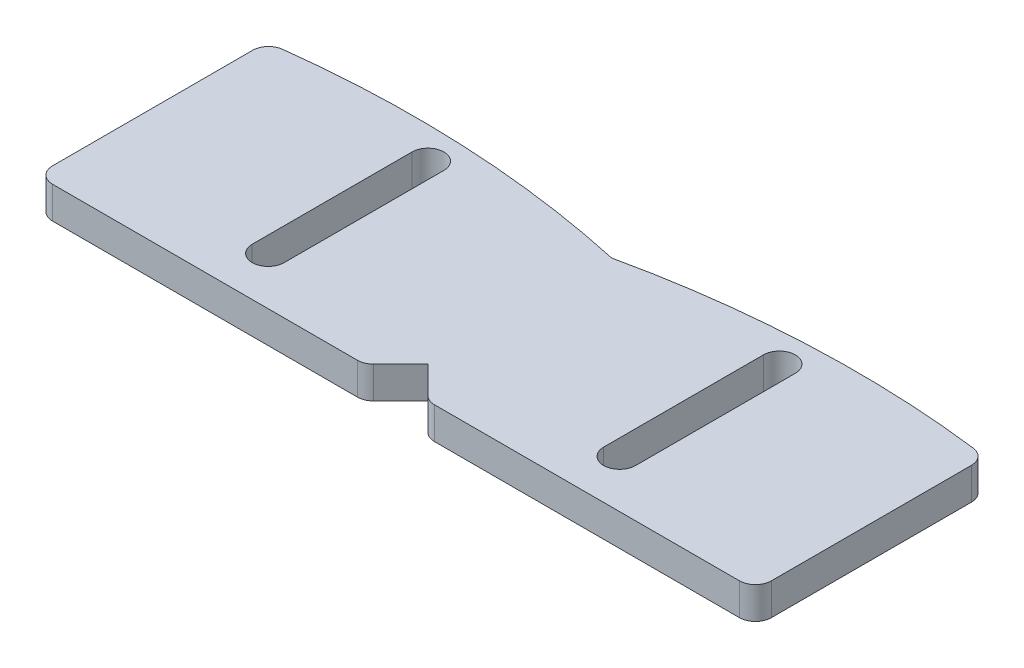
from build123d import *

# Parameters (mm, degrees)
RESSALTO_EXTRUS_O1_DEPTH = 2
FILETE1_R                = 1


with BuildPart() as part:
    # Esbo_o1 → Ressalto-extrus_o1 (new body)
    with BuildSketch(Plane(origin=(0, 0, 0), x_dir=(1, 0, 0), z_dir=(0, 1, 0))):
        with BuildLine():
            ThreePointArc((0, 6), (-6.841228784, 7.123893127), (-13.763951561, 7.5))
            ThreePointArc((-13.763951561, 7.5), (-18.1422658, 7.349823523), (-22.5, 6.9))
            Line((-22.5, 6.9), (-22.5, -7.5))
            Line((-22.5, -7.5), (-2, -7.5))
            Line((-2, -7.5), (0, -5.5))
            Line((0, -5.5), (2, -7.5))
            Line((2, -7.5), (22.5, -7.5))
            Line((22.5, -7.5), (22.5, 6.9))
            ThreePointArc((22.5, 6.9), (18.1422658, 7.349823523), (13.763951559, 7.5))
            ThreePointArc((13.763951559, 7.5), (6.841228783, 7.123893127), (0, 6))
        make_face()
        with BuildLine():
            ThreePointArc((-12, 5.5), (-11, 6.5), (-10, 5.5))
            Line((-10, 5.5), (-10, -4.5))
            ThreePointArc((-10, -4.5), (-11, -5.5), (-12, -4.5))
            Line((-12, -4.5), (-12, 5.5))
        make_face(mode=Mode.SUBTRACT)
        with BuildLine():
            Line((10, -4.5), (10, 5.5))
            ThreePointArc((10, 5.5), (11, 6.5), (12, 5.5))
            Line((12, 5.5), (12, -4.5))
            ThreePointArc((12, -4.5), (11, -5.5), (10, -4.5))
        make_face(mode=Mode.SUBTRACT)
    extrude(amount=RESSALTO_EXTRUS_O1_DEPTH)

    # Filete1
    filete1_edges = [part.edges().sort_by_distance(p)[0] for p in [
        (22.5, 1, -6.9),
        (22.5, 1, 7.5),
        (2, 1, 7.5),
        (-2, 1, 7.5),
        (-22.5, 1, 7.5),
        (-22.5, 1, -6.9),
    ]]
    fillet(filete1_edges, radius=FILETE1_R)


solid = part.part
